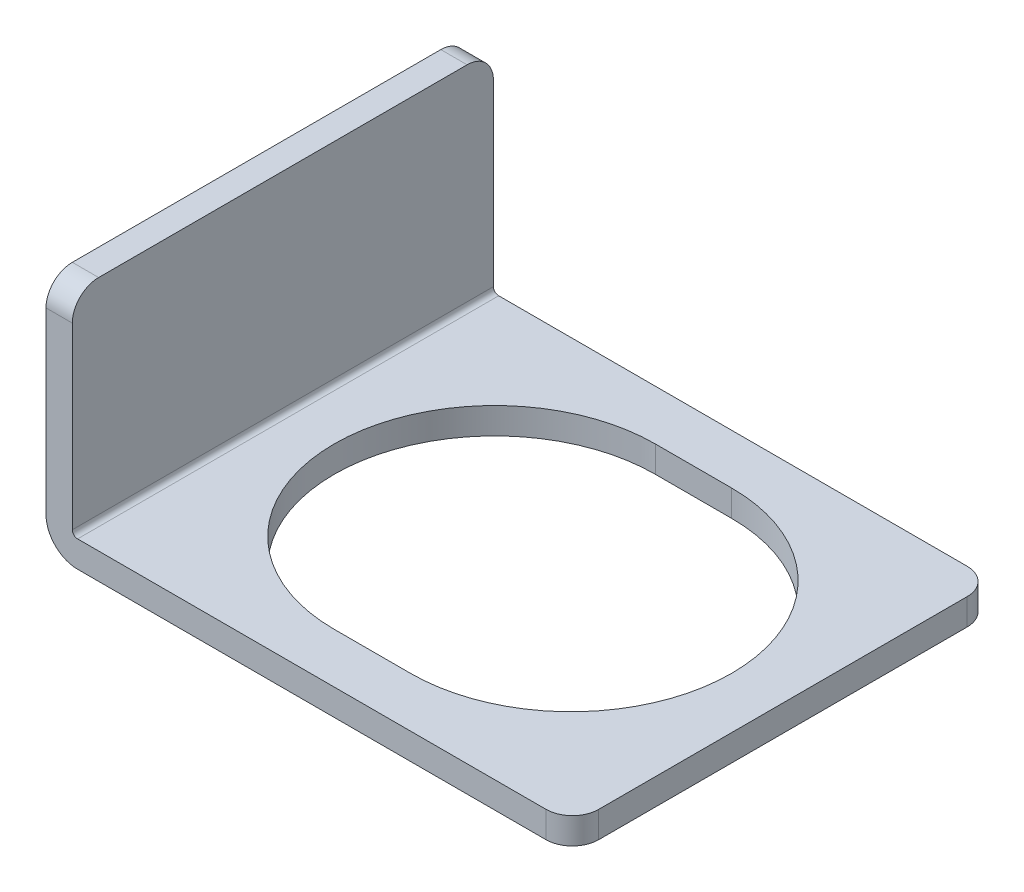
ISO-10303-21;
HEADER;
FILE_DESCRIPTION(('STEP AP214'),'2;1');
FILE_NAME('part.step','',(''),(''),'','','');
FILE_SCHEMA(('AUTOMOTIVE_DESIGN { 1 0 10303 214 1 1 1 1 }'));
ENDSEC;
DATA;
#1=APPLICATION_CONTEXT('core data for automotive mechanical design processes');
#2=APPLICATION_PROTOCOL_DEFINITION('international standard','automotive_design',2000,#1);
#3=PRODUCT_CONTEXT('',#1,'mechanical');
#4=PRODUCT('Part','Part','',(#3));
#5=PRODUCT_RELATED_PRODUCT_CATEGORY('part','',(#4));
#6=PRODUCT_DEFINITION_FORMATION('','',#4);
#7=PRODUCT_DEFINITION_CONTEXT('part definition',#1,'design');
#8=PRODUCT_DEFINITION('design','',#6,#7);
#9=PRODUCT_DEFINITION_SHAPE('','',#8);
#10=(LENGTH_UNIT() NAMED_UNIT(*) SI_UNIT(.MILLI.,.METRE.));
#11=(NAMED_UNIT(*) PLANE_ANGLE_UNIT() SI_UNIT($,.RADIAN.));
#12=(NAMED_UNIT(*) SI_UNIT($,.STERADIAN.) SOLID_ANGLE_UNIT());
#13=UNCERTAINTY_MEASURE_WITH_UNIT(LENGTH_MEASURE(1.E-05),#10,'distance_accuracy_value','');
#14=(GEOMETRIC_REPRESENTATION_CONTEXT(3) GLOBAL_UNCERTAINTY_ASSIGNED_CONTEXT((#13)) GLOBAL_UNIT_ASSIGNED_CONTEXT((#10,
#11,#12)) REPRESENTATION_CONTEXT('',''));
#15=CARTESIAN_POINT('',(0.,0.,0.));
#16=DIRECTION('',(0.,0.,1.));
#17=DIRECTION('',(1.,0.,0.));
#18=AXIS2_PLACEMENT_3D('',#15,#16,#17);
#19=CARTESIAN_POINT('',(0.,9.,8.));
#20=DIRECTION('',(0.,-1.,0.));
#21=DIRECTION('',(0.,0.,-1.));
#22=AXIS2_PLACEMENT_3D('',#19,#20,#21);
#23=PLANE('',#22);
#24=DIRECTION('',(0.,0.,-1.));
#25=VECTOR('',#24,1.);
#26=CARTESIAN_POINT('',(1.,9.,8.));
#27=LINE('',#26,#25);
#28=CARTESIAN_POINT('',(1.,9.,7.));
#29=VERTEX_POINT('',#28);
#30=CARTESIAN_POINT('',(1.,9.,-7.));
#31=VERTEX_POINT('',#30);
#32=EDGE_CURVE('E231',#29,#31,#27,.T.);
#33=ORIENTED_EDGE('',*,*,#32,.T.);
#34=DIRECTION('',(-1.,0.,0.));
#35=VECTOR('',#34,1.);
#36=CARTESIAN_POINT('',(0.,9.,-7.));
#37=LINE('',#36,#35);
#38=CARTESIAN_POINT('',(0.,9.,-7.));
#39=VERTEX_POINT('',#38);
#40=EDGE_CURVE('E283',#31,#39,#37,.T.);
#41=ORIENTED_EDGE('',*,*,#40,.T.);
#42=DIRECTION('',(0.,0.,-1.));
#43=VECTOR('',#42,1.);
#44=CARTESIAN_POINT('',(0.,9.,8.));
#45=LINE('',#44,#43);
#46=CARTESIAN_POINT('',(0.,9.,7.));
#47=VERTEX_POINT('',#46);
#48=EDGE_CURVE('E276',#47,#39,#45,.T.);
#49=ORIENTED_EDGE('',*,*,#48,.F.);
#50=DIRECTION('',(-1.,0.,0.));
#51=VECTOR('',#50,1.);
#52=CARTESIAN_POINT('',(0.,9.,7.));
#53=LINE('',#52,#51);
#54=EDGE_CURVE('E280',#47,#29,#53,.F.);
#55=ORIENTED_EDGE('',*,*,#54,.T.);
#56=EDGE_LOOP('',(#33,#41,#49,#55));
#57=FACE_BOUND('',#56,.T.);
#58=ADVANCED_FACE('F38',(#57),#23,.F.);
#59=CARTESIAN_POINT('',(0.,1.2,8.));
#60=DIRECTION('',(1.,0.,0.));
#61=DIRECTION('',(0.,0.,-1.));
#62=AXIS2_PLACEMENT_3D('',#59,#60,#61);
#63=PLANE('',#62);
#64=ORIENTED_EDGE('',*,*,#48,.T.);
#65=CARTESIAN_POINT('',(0.,8.,-7.));
#66=DIRECTION('',(1.,0.,0.));
#67=DIRECTION('',(0.,0.,-1.));
#68=AXIS2_PLACEMENT_3D('',#65,#66,#67);
#69=CIRCLE('',#68,1.);
#70=CARTESIAN_POINT('',(0.,8.,-8.));
#71=VERTEX_POINT('',#70);
#72=EDGE_CURVE('E290',#39,#71,#69,.F.);
#73=ORIENTED_EDGE('',*,*,#72,.T.);
#74=DIRECTION('',(0.,-1.,0.));
#75=VECTOR('',#74,1.);
#76=CARTESIAN_POINT('',(0.,1.2,-8.));
#77=LINE('',#76,#75);
#78=CARTESIAN_POINT('',(0.,1.2,-8.));
#79=VERTEX_POINT('',#78);
#80=EDGE_CURVE('E205',#71,#79,#77,.T.);
#81=ORIENTED_EDGE('',*,*,#80,.T.);
#82=DIRECTION('',(0.,0.,-1.));
#83=VECTOR('',#82,1.);
#84=CARTESIAN_POINT('',(0.,1.2,8.));
#85=LINE('',#84,#83);
#86=CARTESIAN_POINT('',(0.,1.2,8.));
#87=VERTEX_POINT('',#86);
#88=EDGE_CURVE('E272',#87,#79,#85,.T.);
#89=ORIENTED_EDGE('',*,*,#88,.F.);
#90=DIRECTION('',(0.,-1.,0.));
#91=VECTOR('',#90,1.);
#92=CARTESIAN_POINT('',(0.,1.2,8.));
#93=LINE('',#92,#91);
#94=CARTESIAN_POINT('',(0.,8.,8.));
#95=VERTEX_POINT('',#94);
#96=EDGE_CURVE('E211',#95,#87,#93,.T.);
#97=ORIENTED_EDGE('',*,*,#96,.F.);
#98=CARTESIAN_POINT('',(0.,8.,7.));
#99=DIRECTION('',(1.,0.,0.));
#100=DIRECTION('',(0.,0.,-1.));
#101=AXIS2_PLACEMENT_3D('',#98,#99,#100);
#102=CIRCLE('',#101,1.);
#103=EDGE_CURVE('E287',#95,#47,#102,.F.);
#104=ORIENTED_EDGE('',*,*,#103,.T.);
#105=EDGE_LOOP('',(#64,#73,#81,#89,#97,#104));
#106=FACE_BOUND('',#105,.T.);
#107=ADVANCED_FACE('F331',(#106),#63,.F.);
#108=CARTESIAN_POINT('',(1.2,1.2,8.));
#109=DIRECTION('',(0.,0.,-1.));
#110=DIRECTION('',(-1.,0.,0.));
#111=AXIS2_PLACEMENT_3D('',#108,#109,#110);
#112=CYLINDRICAL_SURFACE('',#111,1.2);
#113=CARTESIAN_POINT('',(1.2,1.2,-8.));
#114=DIRECTION('',(0.,0.,1.));
#115=DIRECTION('',(-1.,0.,0.));
#116=AXIS2_PLACEMENT_3D('',#113,#114,#115);
#117=CIRCLE('',#116,1.2);
#118=CARTESIAN_POINT('',(1.2,0.,-8.));
#119=VERTEX_POINT('',#118);
#120=EDGE_CURVE('E234',#79,#119,#117,.T.);
#121=ORIENTED_EDGE('',*,*,#120,.T.);
#122=DIRECTION('',(0.,0.,-1.));
#123=VECTOR('',#122,1.);
#124=CARTESIAN_POINT('',(1.2,0.,8.));
#125=LINE('',#124,#123);
#126=CARTESIAN_POINT('',(1.2,0.,8.));
#127=VERTEX_POINT('',#126);
#128=EDGE_CURVE('E268',#127,#119,#125,.T.);
#129=ORIENTED_EDGE('',*,*,#128,.F.);
#130=CARTESIAN_POINT('',(1.2,1.2,8.));
#131=DIRECTION('',(0.,0.,1.));
#132=DIRECTION('',(-1.,0.,0.));
#133=AXIS2_PLACEMENT_3D('',#130,#131,#132);
#134=CIRCLE('',#133,1.2);
#135=EDGE_CURVE('E214',#87,#127,#134,.T.);
#136=ORIENTED_EDGE('',*,*,#135,.F.);
#137=ORIENTED_EDGE('',*,*,#88,.T.);
#138=EDGE_LOOP('',(#121,#129,#136,#137));
#139=FACE_BOUND('',#138,.T.);
#140=ADVANCED_FACE('F338',(#139),#112,.T.);
#141=CARTESIAN_POINT('',(1.2,0.,8.));
#142=DIRECTION('',(0.,1.,0.));
#143=DIRECTION('',(0.,0.,1.));
#144=AXIS2_PLACEMENT_3D('',#141,#142,#143);
#145=PLANE('',#144);
#146=DIRECTION('',(-1.,0.,0.));
#147=VECTOR('',#146,1.);
#148=CARTESIAN_POINT('',(9.05,0.,-6.1));
#149=LINE('',#148,#147);
#150=CARTESIAN_POINT('',(11.95,0.,-6.1));
#151=VERTEX_POINT('',#150);
#152=CARTESIAN_POINT('',(9.05,0.,-6.1));
#153=VERTEX_POINT('',#152);
#154=EDGE_CURVE('E167',#151,#153,#149,.T.);
#155=ORIENTED_EDGE('',*,*,#154,.T.);
#156=CARTESIAN_POINT('',(9.05,0.,0.));
#157=DIRECTION('',(0.,1.,0.));
#158=DIRECTION('',(0.,0.,1.));
#159=AXIS2_PLACEMENT_3D('',#156,#157,#158);
#160=CIRCLE('',#159,6.1);
#161=CARTESIAN_POINT('',(9.05,0.,6.1));
#162=VERTEX_POINT('',#161);
#163=EDGE_CURVE('E158',#153,#162,#160,.T.);
#164=ORIENTED_EDGE('',*,*,#163,.T.);
#165=DIRECTION('',(1.,0.,0.));
#166=VECTOR('',#165,1.);
#167=CARTESIAN_POINT('',(9.05,0.,6.1));
#168=LINE('',#167,#166);
#169=CARTESIAN_POINT('',(11.95,0.,6.1));
#170=VERTEX_POINT('',#169);
#171=EDGE_CURVE('E171',#162,#170,#168,.T.);
#172=ORIENTED_EDGE('',*,*,#171,.T.);
#173=CARTESIAN_POINT('',(11.95,0.,0.));
#174=DIRECTION('',(0.,1.,0.));
#175=DIRECTION('',(0.,0.,1.));
#176=AXIS2_PLACEMENT_3D('',#173,#174,#175);
#177=CIRCLE('',#176,6.1);
#178=EDGE_CURVE('E176',#170,#151,#177,.T.);
#179=ORIENTED_EDGE('',*,*,#178,.T.);
#180=EDGE_LOOP('',(#155,#164,#172,#179));
#181=FACE_BOUND('',#180,.T.);
#182=DIRECTION('',(1.,0.,0.));
#183=VECTOR('',#182,1.);
#184=CARTESIAN_POINT('',(1.2,0.,-8.));
#185=LINE('',#184,#183);
#186=CARTESIAN_POINT('',(19.,0.,-8.));
#187=VERTEX_POINT('',#186);
#188=EDGE_CURVE('E237',#119,#187,#185,.T.);
#189=ORIENTED_EDGE('',*,*,#188,.T.);
#190=CARTESIAN_POINT('',(19.,0.,-7.));
#191=DIRECTION('',(0.,1.,0.));
#192=DIRECTION('',(0.,0.,1.));
#193=AXIS2_PLACEMENT_3D('',#190,#191,#192);
#194=CIRCLE('',#193,1.);
#195=CARTESIAN_POINT('',(20.,0.,-7.));
#196=VERTEX_POINT('',#195);
#197=EDGE_CURVE('E318',#187,#196,#194,.F.);
#198=ORIENTED_EDGE('',*,*,#197,.T.);
#199=DIRECTION('',(0.,0.,-1.));
#200=VECTOR('',#199,1.);
#201=CARTESIAN_POINT('',(20.,0.,8.));
#202=LINE('',#201,#200);
#203=CARTESIAN_POINT('',(20.,0.,7.));
#204=VERTEX_POINT('',#203);
#205=EDGE_CURVE('E264',#204,#196,#202,.T.);
#206=ORIENTED_EDGE('',*,*,#205,.F.);
#207=CARTESIAN_POINT('',(19.,0.,7.));
#208=DIRECTION('',(0.,1.,0.));
#209=DIRECTION('',(0.,0.,1.));
#210=AXIS2_PLACEMENT_3D('',#207,#208,#209);
#211=CIRCLE('',#210,1.);
#212=CARTESIAN_POINT('',(19.,0.,8.));
#213=VERTEX_POINT('',#212);
#214=EDGE_CURVE('E54',#204,#213,#211,.F.);
#215=ORIENTED_EDGE('',*,*,#214,.T.);
#216=DIRECTION('',(1.,0.,0.));
#217=VECTOR('',#216,1.);
#218=CARTESIAN_POINT('',(1.2,0.,8.));
#219=LINE('',#218,#217);
#220=EDGE_CURVE('E218',#127,#213,#219,.T.);
#221=ORIENTED_EDGE('',*,*,#220,.F.);
#222=ORIENTED_EDGE('',*,*,#128,.T.);
#223=EDGE_LOOP('',(#189,#198,#206,#215,#221,#222));
#224=FACE_BOUND('',#223,.T.);
#225=ADVANCED_FACE('F178',(#181,#224),#145,.F.);
#226=CARTESIAN_POINT('',(20.,1.,8.));
#227=DIRECTION('',(-1.,0.,0.));
#228=DIRECTION('',(0.,0.,1.));
#229=AXIS2_PLACEMENT_3D('',#226,#227,#228);
#230=PLANE('',#229);
#231=ORIENTED_EDGE('',*,*,#205,.T.);
#232=DIRECTION('',(0.,1.,0.));
#233=VECTOR('',#232,1.);
#234=CARTESIAN_POINT('',(20.,1.,-7.));
#235=LINE('',#234,#233);
#236=CARTESIAN_POINT('',(20.,1.,-7.));
#237=VERTEX_POINT('',#236);
#238=EDGE_CURVE('E307',#196,#237,#235,.T.);
#239=ORIENTED_EDGE('',*,*,#238,.T.);
#240=DIRECTION('',(0.,0.,-1.));
#241=VECTOR('',#240,1.);
#242=CARTESIAN_POINT('',(20.,1.,8.));
#243=LINE('',#242,#241);
#244=CARTESIAN_POINT('',(20.,1.,7.));
#245=VERTEX_POINT('',#244);
#246=EDGE_CURVE('E261',#245,#237,#243,.T.);
#247=ORIENTED_EDGE('',*,*,#246,.F.);
#248=DIRECTION('',(0.,1.,0.));
#249=VECTOR('',#248,1.);
#250=CARTESIAN_POINT('',(20.,1.,7.));
#251=LINE('',#250,#249);
#252=EDGE_CURVE('E304',#245,#204,#251,.F.);
#253=ORIENTED_EDGE('',*,*,#252,.T.);
#254=EDGE_LOOP('',(#231,#239,#247,#253));
#255=FACE_BOUND('',#254,.T.);
#256=ADVANCED_FACE('F343',(#255),#230,.F.);
#257=CARTESIAN_POINT('',(1.2,1.,8.));
#258=DIRECTION('',(0.,-1.,0.));
#259=DIRECTION('',(0.,0.,-1.));
#260=AXIS2_PLACEMENT_3D('',#257,#258,#259);
#261=PLANE('',#260);
#262=DIRECTION('',(1.,0.,0.));
#263=VECTOR('',#262,1.);
#264=CARTESIAN_POINT('',(9.05,1.,6.1));
#265=LINE('',#264,#263);
#266=CARTESIAN_POINT('',(9.05,1.,6.1));
#267=VERTEX_POINT('',#266);
#268=CARTESIAN_POINT('',(11.95,1.,6.1));
#269=VERTEX_POINT('',#268);
#270=EDGE_CURVE('E196',#267,#269,#265,.T.);
#271=ORIENTED_EDGE('',*,*,#270,.F.);
#272=CARTESIAN_POINT('',(9.05,1.,0.));
#273=DIRECTION('',(0.,1.,0.));
#274=DIRECTION('',(0.,0.,1.));
#275=AXIS2_PLACEMENT_3D('',#272,#273,#274);
#276=CIRCLE('',#275,6.1);
#277=CARTESIAN_POINT('',(9.05,1.,-6.1));
#278=VERTEX_POINT('',#277);
#279=EDGE_CURVE('E161',#278,#267,#276,.T.);
#280=ORIENTED_EDGE('',*,*,#279,.F.);
#281=DIRECTION('',(-1.,0.,0.));
#282=VECTOR('',#281,1.);
#283=CARTESIAN_POINT('',(9.05,1.,-6.1));
#284=LINE('',#283,#282);
#285=CARTESIAN_POINT('',(11.95,1.,-6.1));
#286=VERTEX_POINT('',#285);
#287=EDGE_CURVE('E181',#286,#278,#284,.T.);
#288=ORIENTED_EDGE('',*,*,#287,.F.);
#289=CARTESIAN_POINT('',(11.95,1.,0.));
#290=DIRECTION('',(0.,1.,0.));
#291=DIRECTION('',(0.,0.,1.));
#292=AXIS2_PLACEMENT_3D('',#289,#290,#291);
#293=CIRCLE('',#292,6.1);
#294=EDGE_CURVE('E187',#269,#286,#293,.T.);
#295=ORIENTED_EDGE('',*,*,#294,.F.);
#296=EDGE_LOOP('',(#271,#280,#288,#295));
#297=FACE_BOUND('',#296,.T.);
#298=ORIENTED_EDGE('',*,*,#246,.T.);
#299=CARTESIAN_POINT('',(19.,1.,-7.));
#300=DIRECTION('',(0.,-1.,0.));
#301=DIRECTION('',(0.,0.,-1.));
#302=AXIS2_PLACEMENT_3D('',#299,#300,#301);
#303=CIRCLE('',#302,1.);
#304=CARTESIAN_POINT('',(19.,1.,-8.));
#305=VERTEX_POINT('',#304);
#306=EDGE_CURVE('E313',#237,#305,#303,.F.);
#307=ORIENTED_EDGE('',*,*,#306,.T.);
#308=DIRECTION('',(-1.,0.,0.));
#309=VECTOR('',#308,1.);
#310=CARTESIAN_POINT('',(1.2,1.,-8.));
#311=LINE('',#310,#309);
#312=CARTESIAN_POINT('',(1.2,1.,-8.));
#313=VERTEX_POINT('',#312);
#314=EDGE_CURVE('E241',#305,#313,#311,.T.);
#315=ORIENTED_EDGE('',*,*,#314,.T.);
#316=DIRECTION('',(0.,0.,-1.));
#317=VECTOR('',#316,1.);
#318=CARTESIAN_POINT('',(1.2,1.,8.));
#319=LINE('',#318,#317);
#320=CARTESIAN_POINT('',(1.2,1.,8.));
#321=VERTEX_POINT('',#320);
#322=EDGE_CURVE('E257',#321,#313,#319,.T.);
#323=ORIENTED_EDGE('',*,*,#322,.F.);
#324=DIRECTION('',(-1.,0.,0.));
#325=VECTOR('',#324,1.);
#326=CARTESIAN_POINT('',(1.2,1.,8.));
#327=LINE('',#326,#325);
#328=CARTESIAN_POINT('',(19.,1.,8.));
#329=VERTEX_POINT('',#328);
#330=EDGE_CURVE('E221',#329,#321,#327,.T.);
#331=ORIENTED_EDGE('',*,*,#330,.F.);
#332=CARTESIAN_POINT('',(19.,1.,7.));
#333=DIRECTION('',(0.,-1.,0.));
#334=DIRECTION('',(0.,0.,-1.));
#335=AXIS2_PLACEMENT_3D('',#332,#333,#334);
#336=CIRCLE('',#335,1.);
#337=EDGE_CURVE('E62',#329,#245,#336,.F.);
#338=ORIENTED_EDGE('',*,*,#337,.T.);
#339=EDGE_LOOP('',(#298,#307,#315,#323,#331,#338));
#340=FACE_BOUND('',#339,.T.);
#341=ADVANCED_FACE('F351',(#297,#340),#261,.F.);
#342=CARTESIAN_POINT('',(1.2,1.2,8.));
#343=DIRECTION('',(0.,0.,-1.));
#344=DIRECTION('',(-1.,0.,0.));
#345=AXIS2_PLACEMENT_3D('',#342,#343,#344);
#346=CYLINDRICAL_SURFACE('',#345,0.2);
#347=CARTESIAN_POINT('',(1.2,1.2,-8.));
#348=DIRECTION('',(0.,0.,-1.));
#349=DIRECTION('',(-1.,0.,0.));
#350=AXIS2_PLACEMENT_3D('',#347,#348,#349);
#351=CIRCLE('',#350,0.2);
#352=CARTESIAN_POINT('',(1.,1.2,-8.));
#353=VERTEX_POINT('',#352);
#354=EDGE_CURVE('E244',#313,#353,#351,.T.);
#355=ORIENTED_EDGE('',*,*,#354,.T.);
#356=DIRECTION('',(0.,0.,-1.));
#357=VECTOR('',#356,1.);
#358=CARTESIAN_POINT('',(1.,1.2,8.));
#359=LINE('',#358,#357);
#360=CARTESIAN_POINT('',(1.,1.2,8.));
#361=VERTEX_POINT('',#360);
#362=EDGE_CURVE('E253',#361,#353,#359,.T.);
#363=ORIENTED_EDGE('',*,*,#362,.F.);
#364=CARTESIAN_POINT('',(1.2,1.2,8.));
#365=DIRECTION('',(0.,0.,-1.));
#366=DIRECTION('',(-1.,0.,0.));
#367=AXIS2_PLACEMENT_3D('',#364,#365,#366);
#368=CIRCLE('',#367,0.2);
#369=EDGE_CURVE('E224',#321,#361,#368,.T.);
#370=ORIENTED_EDGE('',*,*,#369,.F.);
#371=ORIENTED_EDGE('',*,*,#322,.T.);
#372=EDGE_LOOP('',(#355,#363,#370,#371));
#373=FACE_BOUND('',#372,.T.);
#374=ADVANCED_FACE('F357',(#373),#346,.F.);
#375=CARTESIAN_POINT('',(1.,1.2,8.));
#376=DIRECTION('',(-1.,0.,0.));
#377=DIRECTION('',(0.,0.,1.));
#378=AXIS2_PLACEMENT_3D('',#375,#376,#377);
#379=PLANE('',#378);
#380=DIRECTION('',(0.,1.,0.));
#381=VECTOR('',#380,1.);
#382=CARTESIAN_POINT('',(1.,1.2,-8.));
#383=LINE('',#382,#381);
#384=CARTESIAN_POINT('',(1.,8.,-8.));
#385=VERTEX_POINT('',#384);
#386=EDGE_CURVE('E215',#353,#385,#383,.T.);
#387=ORIENTED_EDGE('',*,*,#386,.T.);
#388=CARTESIAN_POINT('',(1.,8.,-7.));
#389=DIRECTION('',(-1.,0.,0.));
#390=DIRECTION('',(0.,0.,1.));
#391=AXIS2_PLACEMENT_3D('',#388,#389,#390);
#392=CIRCLE('',#391,1.);
#393=EDGE_CURVE('E301',#385,#31,#392,.F.);
#394=ORIENTED_EDGE('',*,*,#393,.T.);
#395=ORIENTED_EDGE('',*,*,#32,.F.);
#396=CARTESIAN_POINT('',(1.,8.,7.));
#397=DIRECTION('',(-1.,0.,0.));
#398=DIRECTION('',(0.,0.,1.));
#399=AXIS2_PLACEMENT_3D('',#396,#397,#398);
#400=CIRCLE('',#399,1.);
#401=CARTESIAN_POINT('',(1.,8.,8.));
#402=VERTEX_POINT('',#401);
#403=EDGE_CURVE('E299',#29,#402,#400,.F.);
#404=ORIENTED_EDGE('',*,*,#403,.T.);
#405=DIRECTION('',(0.,1.,0.));
#406=VECTOR('',#405,1.);
#407=CARTESIAN_POINT('',(1.,1.2,8.));
#408=LINE('',#407,#406);
#409=EDGE_CURVE('E227',#361,#402,#408,.T.);
#410=ORIENTED_EDGE('',*,*,#409,.F.);
#411=ORIENTED_EDGE('',*,*,#362,.T.);
#412=EDGE_LOOP('',(#387,#394,#395,#404,#410,#411));
#413=FACE_BOUND('',#412,.T.);
#414=ADVANCED_FACE('F361',(#413),#379,.F.);
#415=CARTESIAN_POINT('',(1.2,1.2,8.));
#416=DIRECTION('',(0.,0.,-1.));
#417=DIRECTION('',(-1.,0.,0.));
#418=AXIS2_PLACEMENT_3D('',#415,#416,#417);
#419=PLANE('',#418);
#420=ORIENTED_EDGE('',*,*,#220,.T.);
#421=DIRECTION('',(0.,1.,0.));
#422=VECTOR('',#421,1.);
#423=CARTESIAN_POINT('',(19.,1.2,8.));
#424=LINE('',#423,#422);
#425=EDGE_CURVE('E11',#213,#329,#424,.T.);
#426=ORIENTED_EDGE('',*,*,#425,.T.);
#427=ORIENTED_EDGE('',*,*,#330,.T.);
#428=ORIENTED_EDGE('',*,*,#369,.T.);
#429=ORIENTED_EDGE('',*,*,#409,.T.);
#430=DIRECTION('',(-1.,0.,0.));
#431=VECTOR('',#430,1.);
#432=CARTESIAN_POINT('',(1.2,8.,8.));
#433=LINE('',#432,#431);
#434=EDGE_CURVE('E47',#402,#95,#433,.T.);
#435=ORIENTED_EDGE('',*,*,#434,.T.);
#436=ORIENTED_EDGE('',*,*,#96,.T.);
#437=ORIENTED_EDGE('',*,*,#135,.T.);
#438=EDGE_LOOP('',(#420,#426,#427,#428,#429,#435,#436,#437));
#439=FACE_BOUND('',#438,.T.);
#440=ADVANCED_FACE('F325',(#439),#419,.F.);
#441=CARTESIAN_POINT('',(1.2,1.2,-8.));
#442=DIRECTION('',(0.,0.,-1.));
#443=DIRECTION('',(-1.,0.,0.));
#444=AXIS2_PLACEMENT_3D('',#441,#442,#443);
#445=PLANE('',#444);
#446=ORIENTED_EDGE('',*,*,#80,.F.);
#447=DIRECTION('',(-1.,0.,0.));
#448=VECTOR('',#447,1.);
#449=CARTESIAN_POINT('',(1.,8.,-8.));
#450=LINE('',#449,#448);
#451=EDGE_CURVE('E296',#71,#385,#450,.F.);
#452=ORIENTED_EDGE('',*,*,#451,.T.);
#453=ORIENTED_EDGE('',*,*,#386,.F.);
#454=ORIENTED_EDGE('',*,*,#354,.F.);
#455=ORIENTED_EDGE('',*,*,#314,.F.);
#456=DIRECTION('',(0.,1.,0.));
#457=VECTOR('',#456,1.);
#458=CARTESIAN_POINT('',(19.,0.,-8.));
#459=LINE('',#458,#457);
#460=EDGE_CURVE('E293',#305,#187,#459,.F.);
#461=ORIENTED_EDGE('',*,*,#460,.T.);
#462=ORIENTED_EDGE('',*,*,#188,.F.);
#463=ORIENTED_EDGE('',*,*,#120,.F.);
#464=EDGE_LOOP('',(#446,#452,#453,#454,#455,#461,#462,#463));
#465=FACE_BOUND('',#464,.T.);
#466=ADVANCED_FACE('F369',(#465),#445,.T.);
#467=CARTESIAN_POINT('',(9.05,0.,0.));
#468=DIRECTION('',(0.,1.,0.));
#469=DIRECTION('',(0.,0.,1.));
#470=AXIS2_PLACEMENT_3D('',#467,#468,#469);
#471=CYLINDRICAL_SURFACE('',#470,6.1);
#472=ORIENTED_EDGE('',*,*,#279,.T.);
#473=DIRECTION('',(0.,1.,0.));
#474=VECTOR('',#473,1.);
#475=CARTESIAN_POINT('',(9.05,0.,6.1));
#476=LINE('',#475,#474);
#477=EDGE_CURVE('E154',#162,#267,#476,.T.);
#478=ORIENTED_EDGE('',*,*,#477,.F.);
#479=ORIENTED_EDGE('',*,*,#163,.F.);
#480=DIRECTION('',(0.,1.,0.));
#481=VECTOR('',#480,1.);
#482=CARTESIAN_POINT('',(9.05,0.,-6.1));
#483=LINE('',#482,#481);
#484=EDGE_CURVE('E202',#153,#278,#483,.T.);
#485=ORIENTED_EDGE('',*,*,#484,.T.);
#486=EDGE_LOOP('',(#472,#478,#479,#485));
#487=FACE_BOUND('',#486,.T.);
#488=ADVANCED_FACE('F156',(#487),#471,.F.);
#489=CARTESIAN_POINT('',(9.05,0.,-6.1));
#490=DIRECTION('',(0.,0.,-1.));
#491=DIRECTION('',(-1.,0.,0.));
#492=AXIS2_PLACEMENT_3D('',#489,#490,#491);
#493=PLANE('',#492);
#494=ORIENTED_EDGE('',*,*,#287,.T.);
#495=ORIENTED_EDGE('',*,*,#484,.F.);
#496=ORIENTED_EDGE('',*,*,#154,.F.);
#497=DIRECTION('',(0.,1.,0.));
#498=VECTOR('',#497,1.);
#499=CARTESIAN_POINT('',(11.95,0.,-6.1));
#500=LINE('',#499,#498);
#501=EDGE_CURVE('E206',#151,#286,#500,.T.);
#502=ORIENTED_EDGE('',*,*,#501,.T.);
#503=EDGE_LOOP('',(#494,#495,#496,#502));
#504=FACE_BOUND('',#503,.T.);
#505=ADVANCED_FACE('F406',(#504),#493,.F.);
#506=CARTESIAN_POINT('',(11.95,0.,0.));
#507=DIRECTION('',(0.,1.,0.));
#508=DIRECTION('',(0.,0.,1.));
#509=AXIS2_PLACEMENT_3D('',#506,#507,#508);
#510=CYLINDRICAL_SURFACE('',#509,6.1);
#511=ORIENTED_EDGE('',*,*,#294,.T.);
#512=ORIENTED_EDGE('',*,*,#501,.F.);
#513=ORIENTED_EDGE('',*,*,#178,.F.);
#514=DIRECTION('',(0.,1.,0.));
#515=VECTOR('',#514,1.);
#516=CARTESIAN_POINT('',(11.95,0.,6.1));
#517=LINE('',#516,#515);
#518=EDGE_CURVE('E166',#170,#269,#517,.T.);
#519=ORIENTED_EDGE('',*,*,#518,.T.);
#520=EDGE_LOOP('',(#511,#512,#513,#519));
#521=FACE_BOUND('',#520,.T.);
#522=ADVANCED_FACE('F379',(#521),#510,.F.);
#523=CARTESIAN_POINT('',(9.05,0.,6.1));
#524=DIRECTION('',(0.,0.,1.));
#525=DIRECTION('',(1.,0.,0.));
#526=AXIS2_PLACEMENT_3D('',#523,#524,#525);
#527=PLANE('',#526);
#528=ORIENTED_EDGE('',*,*,#270,.T.);
#529=ORIENTED_EDGE('',*,*,#518,.F.);
#530=ORIENTED_EDGE('',*,*,#171,.F.);
#531=ORIENTED_EDGE('',*,*,#477,.T.);
#532=EDGE_LOOP('',(#528,#529,#530,#531));
#533=FACE_BOUND('',#532,.T.);
#534=ADVANCED_FACE('F172',(#533),#527,.F.);
#535=CARTESIAN_POINT('',(0.,8.,-7.));
#536=DIRECTION('',(1.,0.,0.));
#537=DIRECTION('',(0.,0.,-1.));
#538=AXIS2_PLACEMENT_3D('',#535,#536,#537);
#539=CYLINDRICAL_SURFACE('',#538,1.);
#540=ORIENTED_EDGE('',*,*,#393,.F.);
#541=ORIENTED_EDGE('',*,*,#451,.F.);
#542=ORIENTED_EDGE('',*,*,#72,.F.);
#543=ORIENTED_EDGE('',*,*,#40,.F.);
#544=EDGE_LOOP('',(#540,#541,#542,#543));
#545=FACE_BOUND('',#544,.T.);
#546=ADVANCED_FACE('F371',(#545),#539,.T.);
#547=CARTESIAN_POINT('',(19.,1.,-7.));
#548=DIRECTION('',(0.,-1.,0.));
#549=DIRECTION('',(0.,0.,-1.));
#550=AXIS2_PLACEMENT_3D('',#547,#548,#549);
#551=CYLINDRICAL_SURFACE('',#550,1.);
#552=ORIENTED_EDGE('',*,*,#197,.F.);
#553=ORIENTED_EDGE('',*,*,#460,.F.);
#554=ORIENTED_EDGE('',*,*,#306,.F.);
#555=ORIENTED_EDGE('',*,*,#238,.F.);
#556=EDGE_LOOP('',(#552,#553,#554,#555));
#557=FACE_BOUND('',#556,.T.);
#558=ADVANCED_FACE('F349',(#557),#551,.T.);
#559=CARTESIAN_POINT('',(19.,1.2,7.));
#560=DIRECTION('',(0.,1.,0.));
#561=DIRECTION('',(0.,0.,1.));
#562=AXIS2_PLACEMENT_3D('',#559,#560,#561);
#563=CYLINDRICAL_SURFACE('',#562,1.);
#564=ORIENTED_EDGE('',*,*,#214,.F.);
#565=ORIENTED_EDGE('',*,*,#252,.F.);
#566=ORIENTED_EDGE('',*,*,#337,.F.);
#567=ORIENTED_EDGE('',*,*,#425,.F.);
#568=EDGE_LOOP('',(#564,#565,#566,#567));
#569=FACE_BOUND('',#568,.T.);
#570=ADVANCED_FACE('F340',(#569),#563,.T.);
#571=CARTESIAN_POINT('',(1.2,8.,7.));
#572=DIRECTION('',(-1.,0.,0.));
#573=DIRECTION('',(0.,0.,1.));
#574=AXIS2_PLACEMENT_3D('',#571,#572,#573);
#575=CYLINDRICAL_SURFACE('',#574,1.);
#576=ORIENTED_EDGE('',*,*,#403,.F.);
#577=ORIENTED_EDGE('',*,*,#54,.F.);
#578=ORIENTED_EDGE('',*,*,#103,.F.);
#579=ORIENTED_EDGE('',*,*,#434,.F.);
#580=EDGE_LOOP('',(#576,#577,#578,#579));
#581=FACE_BOUND('',#580,.T.);
#582=ADVANCED_FACE('F40',(#581),#575,.T.);
#583=CLOSED_SHELL('',(#58,#107,#140,#225,#256,#341,#374,#414,#440,#466,#488,#505,#522,#534,#546,
#558,#570,#582));
#584=MANIFOLD_SOLID_BREP('B2',#583);
#585=ADVANCED_BREP_SHAPE_REPRESENTATION('',(#18,#584),#14);
#586=SHAPE_DEFINITION_REPRESENTATION(#9,#585);
ENDSEC;
END-ISO-10303-21;
